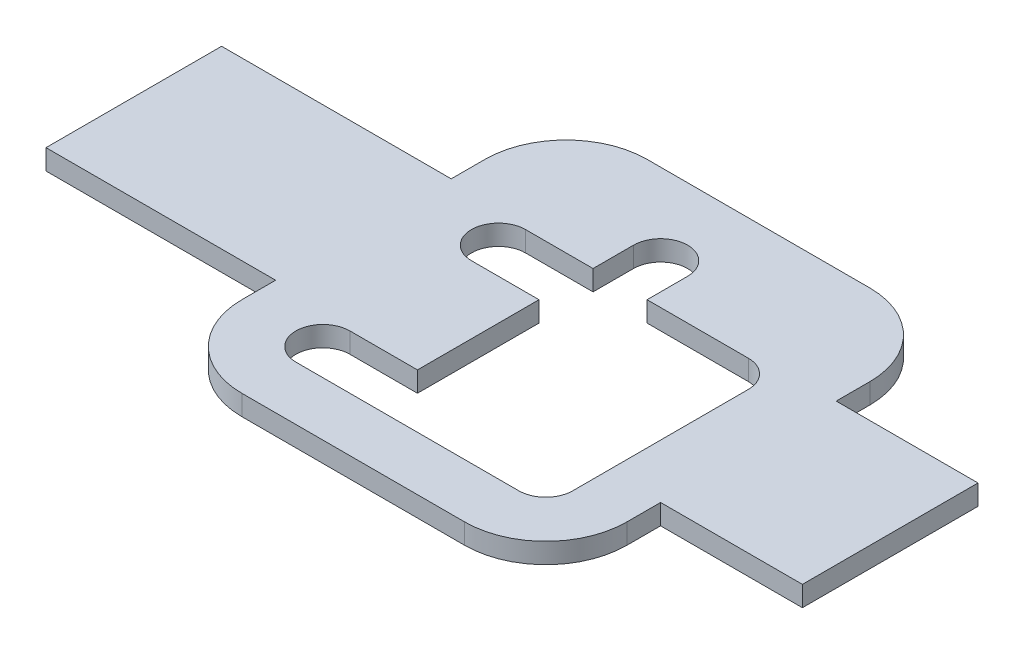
ISO-10303-21;
HEADER;
FILE_DESCRIPTION(('STEP AP214'),'2;1');
FILE_NAME('part.step','',(''),(''),'','','');
FILE_SCHEMA(('AUTOMOTIVE_DESIGN { 1 0 10303 214 1 1 1 1 }'));
ENDSEC;
DATA;
#1=APPLICATION_CONTEXT('core data for automotive mechanical design processes');
#2=APPLICATION_PROTOCOL_DEFINITION('international standard','automotive_design',2000,#1);
#3=PRODUCT_CONTEXT('',#1,'mechanical');
#4=PRODUCT('Part','Part','',(#3));
#5=PRODUCT_RELATED_PRODUCT_CATEGORY('part','',(#4));
#6=PRODUCT_DEFINITION_FORMATION('','',#4);
#7=PRODUCT_DEFINITION_CONTEXT('part definition',#1,'design');
#8=PRODUCT_DEFINITION('design','',#6,#7);
#9=PRODUCT_DEFINITION_SHAPE('','',#8);
#10=(LENGTH_UNIT() NAMED_UNIT(*) SI_UNIT(.MILLI.,.METRE.));
#11=(NAMED_UNIT(*) PLANE_ANGLE_UNIT() SI_UNIT($,.RADIAN.));
#12=(NAMED_UNIT(*) SI_UNIT($,.STERADIAN.) SOLID_ANGLE_UNIT());
#13=UNCERTAINTY_MEASURE_WITH_UNIT(LENGTH_MEASURE(1.E-05),#10,'distance_accuracy_value','');
#14=(GEOMETRIC_REPRESENTATION_CONTEXT(3) GLOBAL_UNCERTAINTY_ASSIGNED_CONTEXT((#13)) GLOBAL_UNIT_ASSIGNED_CONTEXT((#10,
#11,#12)) REPRESENTATION_CONTEXT('',''));
#15=CARTESIAN_POINT('',(0.,0.,0.));
#16=DIRECTION('',(0.,0.,1.));
#17=DIRECTION('',(1.,0.,0.));
#18=AXIS2_PLACEMENT_3D('',#15,#16,#17);
#19=CARTESIAN_POINT('',(46.,3.,5.00000000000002));
#20=DIRECTION('',(0.,-1.,0.));
#21=DIRECTION('',(0.,0.,-1.));
#22=AXIS2_PLACEMENT_3D('',#19,#20,#21);
#23=PLANE('',#22);
#24=DIRECTION('',(0.,0.,1.));
#25=VECTOR('',#24,1.);
#26=CARTESIAN_POINT('',(0.,3.,-26.));
#27=LINE('',#26,#25);
#28=CARTESIAN_POINT('',(0.,3.,-26.));
#29=VERTEX_POINT('',#28);
#30=CARTESIAN_POINT('',(0.,3.,0.));
#31=VERTEX_POINT('',#30);
#32=EDGE_CURVE('E335',#29,#31,#27,.T.);
#33=ORIENTED_EDGE('',*,*,#32,.T.);
#34=DIRECTION('',(1.,0.,0.));
#35=VECTOR('',#34,1.);
#36=CARTESIAN_POINT('',(0.,3.,0.));
#37=LINE('',#36,#35);
#38=CARTESIAN_POINT('',(34.,3.,0.));
#39=VERTEX_POINT('',#38);
#40=EDGE_CURVE('E338',#31,#39,#37,.T.);
#41=ORIENTED_EDGE('',*,*,#40,.T.);
#42=DIRECTION('',(0.,0.,1.));
#43=VECTOR('',#42,1.);
#44=CARTESIAN_POINT('',(34.,3.,0.));
#45=LINE('',#44,#43);
#46=CARTESIAN_POINT('',(34.,3.,5.00000000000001));
#47=VERTEX_POINT('',#46);
#48=EDGE_CURVE('E341',#39,#47,#45,.T.);
#49=ORIENTED_EDGE('',*,*,#48,.T.);
#50=CARTESIAN_POINT('',(46.,3.,5.00000000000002));
#51=DIRECTION('',(0.,1.,0.));
#52=DIRECTION('',(0.,0.,-1.));
#53=AXIS2_PLACEMENT_3D('',#50,#51,#52);
#54=CIRCLE('',#53,12.);
#55=CARTESIAN_POINT('',(46.,3.,17.));
#56=VERTEX_POINT('',#55);
#57=EDGE_CURVE('E343',#47,#56,#54,.T.);
#58=ORIENTED_EDGE('',*,*,#57,.T.);
#59=DIRECTION('',(1.,0.,0.));
#60=VECTOR('',#59,1.);
#61=CARTESIAN_POINT('',(46.,3.,17.));
#62=LINE('',#61,#60);
#63=CARTESIAN_POINT('',(78.9999999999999,3.,17.));
#64=VERTEX_POINT('',#63);
#65=EDGE_CURVE('E345',#56,#64,#62,.T.);
#66=ORIENTED_EDGE('',*,*,#65,.T.);
#67=CARTESIAN_POINT('',(79.,3.,5.00000000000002));
#68=DIRECTION('',(0.,1.,0.));
#69=DIRECTION('',(0.,0.,1.));
#70=AXIS2_PLACEMENT_3D('',#67,#68,#69);
#71=CIRCLE('',#70,12.);
#72=CARTESIAN_POINT('',(91.,3.,4.99999999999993));
#73=VERTEX_POINT('',#72);
#74=EDGE_CURVE('E347',#64,#73,#71,.T.);
#75=ORIENTED_EDGE('',*,*,#74,.T.);
#76=DIRECTION('',(0.,0.,-1.));
#77=VECTOR('',#76,1.);
#78=CARTESIAN_POINT('',(91.,3.,4.99999999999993));
#79=LINE('',#78,#77);
#80=CARTESIAN_POINT('',(91.,3.,0.));
#81=VERTEX_POINT('',#80);
#82=EDGE_CURVE('E349',#73,#81,#79,.T.);
#83=ORIENTED_EDGE('',*,*,#82,.T.);
#84=DIRECTION('',(1.,0.,0.));
#85=VECTOR('',#84,1.);
#86=CARTESIAN_POINT('',(91.,3.,0.));
#87=LINE('',#86,#85);
#88=CARTESIAN_POINT('',(112.,3.,0.));
#89=VERTEX_POINT('',#88);
#90=EDGE_CURVE('E351',#81,#89,#87,.T.);
#91=ORIENTED_EDGE('',*,*,#90,.T.);
#92=DIRECTION('',(0.,0.,-1.));
#93=VECTOR('',#92,1.);
#94=CARTESIAN_POINT('',(112.,3.,0.));
#95=LINE('',#94,#93);
#96=CARTESIAN_POINT('',(112.,3.,-26.));
#97=VERTEX_POINT('',#96);
#98=EDGE_CURVE('E353',#89,#97,#95,.T.);
#99=ORIENTED_EDGE('',*,*,#98,.T.);
#100=DIRECTION('',(-1.,0.,0.));
#101=VECTOR('',#100,1.);
#102=CARTESIAN_POINT('',(112.,3.,-26.));
#103=LINE('',#102,#101);
#104=CARTESIAN_POINT('',(91.,3.,-26.));
#105=VERTEX_POINT('',#104);
#106=EDGE_CURVE('E355',#97,#105,#103,.T.);
#107=ORIENTED_EDGE('',*,*,#106,.T.);
#108=DIRECTION('',(0.,0.,-1.));
#109=VECTOR('',#108,1.);
#110=CARTESIAN_POINT('',(91.,3.,-26.));
#111=LINE('',#110,#109);
#112=CARTESIAN_POINT('',(91.,3.,-31.));
#113=VERTEX_POINT('',#112);
#114=EDGE_CURVE('E357',#105,#113,#111,.T.);
#115=ORIENTED_EDGE('',*,*,#114,.T.);
#116=CARTESIAN_POINT('',(79.,3.,-31.));
#117=DIRECTION('',(0.,1.,0.));
#118=DIRECTION('',(0.,0.,1.));
#119=AXIS2_PLACEMENT_3D('',#116,#117,#118);
#120=CIRCLE('',#119,12.);
#121=CARTESIAN_POINT('',(79.,3.,-43.));
#122=VERTEX_POINT('',#121);
#123=EDGE_CURVE('E359',#113,#122,#120,.T.);
#124=ORIENTED_EDGE('',*,*,#123,.T.);
#125=DIRECTION('',(-1.,0.,0.));
#126=VECTOR('',#125,1.);
#127=CARTESIAN_POINT('',(79.,3.,-43.));
#128=LINE('',#127,#126);
#129=CARTESIAN_POINT('',(46.,3.,-43.));
#130=VERTEX_POINT('',#129);
#131=EDGE_CURVE('E361',#122,#130,#128,.T.);
#132=ORIENTED_EDGE('',*,*,#131,.T.);
#133=CARTESIAN_POINT('',(46.,3.,-31.));
#134=DIRECTION('',(0.,1.,0.));
#135=DIRECTION('',(0.,0.,-1.));
#136=AXIS2_PLACEMENT_3D('',#133,#134,#135);
#137=CIRCLE('',#136,12.);
#138=CARTESIAN_POINT('',(34.,3.,-31.));
#139=VERTEX_POINT('',#138);
#140=EDGE_CURVE('E363',#130,#139,#137,.T.);
#141=ORIENTED_EDGE('',*,*,#140,.T.);
#142=DIRECTION('',(0.,0.,1.));
#143=VECTOR('',#142,1.);
#144=CARTESIAN_POINT('',(34.,3.,-31.));
#145=LINE('',#144,#143);
#146=CARTESIAN_POINT('',(34.,3.,-26.));
#147=VERTEX_POINT('',#146);
#148=EDGE_CURVE('E365',#139,#147,#145,.T.);
#149=ORIENTED_EDGE('',*,*,#148,.T.);
#150=DIRECTION('',(-1.,0.,0.));
#151=VECTOR('',#150,1.);
#152=CARTESIAN_POINT('',(34.,3.,-26.));
#153=LINE('',#152,#151);
#154=EDGE_CURVE('E367',#147,#29,#153,.T.);
#155=ORIENTED_EDGE('',*,*,#154,.T.);
#156=EDGE_LOOP('',(#33,#41,#49,#58,#66,#75,#83,#91,#99,#107,#115,#124,#132,#141,#149,#155));
#157=FACE_BOUND('',#156,.T.);
#158=CARTESIAN_POINT('',(79.,3.,5.00000000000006));
#159=DIRECTION('',(0.,1.,0.));
#160=DIRECTION('',(0.,0.,1.));
#161=AXIS2_PLACEMENT_3D('',#158,#159,#160);
#162=CIRCLE('',#161,4.);
#163=CARTESIAN_POINT('',(79.,3.,9.00000000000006));
#164=VERTEX_POINT('',#163);
#165=CARTESIAN_POINT('',(83.,3.,5.00000000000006));
#166=VERTEX_POINT('',#165);
#167=EDGE_CURVE('E228',#164,#166,#162,.T.);
#168=ORIENTED_EDGE('',*,*,#167,.F.);
#169=DIRECTION('',(1.,0.,0.));
#170=VECTOR('',#169,1.);
#171=CARTESIAN_POINT('',(46.,3.,9.00000000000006));
#172=LINE('',#171,#170);
#173=CARTESIAN_POINT('',(46.,3.,9.00000000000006));
#174=VERTEX_POINT('',#173);
#175=EDGE_CURVE('E273',#174,#164,#172,.T.);
#176=ORIENTED_EDGE('',*,*,#175,.F.);
#177=CARTESIAN_POINT('',(46.,3.,5.00000000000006));
#178=DIRECTION('',(0.,1.,0.));
#179=DIRECTION('',(0.,0.,1.));
#180=AXIS2_PLACEMENT_3D('',#177,#178,#179);
#181=CIRCLE('',#180,4.);
#182=CARTESIAN_POINT('',(46.,3.,1.00000000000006));
#183=VERTEX_POINT('',#182);
#184=EDGE_CURVE('E271',#183,#174,#181,.T.);
#185=ORIENTED_EDGE('',*,*,#184,.F.);
#186=DIRECTION('',(-1.,0.,0.));
#187=VECTOR('',#186,1.);
#188=CARTESIAN_POINT('',(46.,3.,1.00000000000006));
#189=LINE('',#188,#187);
#190=CARTESIAN_POINT('',(56.,3.,1.00000000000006));
#191=VERTEX_POINT('',#190);
#192=EDGE_CURVE('E269',#191,#183,#189,.T.);
#193=ORIENTED_EDGE('',*,*,#192,.F.);
#194=DIRECTION('',(0.,0.,1.));
#195=VECTOR('',#194,1.);
#196=CARTESIAN_POINT('',(56.,3.,-16.9999999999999));
#197=LINE('',#196,#195);
#198=CARTESIAN_POINT('',(56.,3.,-16.9999999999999));
#199=VERTEX_POINT('',#198);
#200=EDGE_CURVE('E267',#199,#191,#197,.T.);
#201=ORIENTED_EDGE('',*,*,#200,.F.);
#202=DIRECTION('',(1.,0.,0.));
#203=VECTOR('',#202,1.);
#204=CARTESIAN_POINT('',(46.,3.,-16.9999999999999));
#205=LINE('',#204,#203);
#206=CARTESIAN_POINT('',(46.,3.,-16.9999999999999));
#207=VERTEX_POINT('',#206);
#208=EDGE_CURVE('E265',#207,#199,#205,.T.);
#209=ORIENTED_EDGE('',*,*,#208,.F.);
#210=CARTESIAN_POINT('',(46.,3.,-20.9999999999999));
#211=DIRECTION('',(0.,1.,0.));
#212=DIRECTION('',(0.,0.,1.));
#213=AXIS2_PLACEMENT_3D('',#210,#211,#212);
#214=CIRCLE('',#213,4.);
#215=CARTESIAN_POINT('',(46.,3.,-24.9999999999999));
#216=VERTEX_POINT('',#215);
#217=EDGE_CURVE('E263',#216,#207,#214,.T.);
#218=ORIENTED_EDGE('',*,*,#217,.F.);
#219=DIRECTION('',(-1.,0.,0.));
#220=VECTOR('',#219,1.);
#221=CARTESIAN_POINT('',(56.,3.,-24.9999999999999));
#222=LINE('',#221,#220);
#223=CARTESIAN_POINT('',(56.,3.,-24.9999999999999));
#224=VERTEX_POINT('',#223);
#225=EDGE_CURVE('E261',#224,#216,#222,.T.);
#226=ORIENTED_EDGE('',*,*,#225,.F.);
#227=DIRECTION('',(0.,0.,1.));
#228=VECTOR('',#227,1.);
#229=CARTESIAN_POINT('',(56.,3.,-30.9999999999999));
#230=LINE('',#229,#228);
#231=CARTESIAN_POINT('',(56.,3.,-30.9999999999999));
#232=VERTEX_POINT('',#231);
#233=EDGE_CURVE('E259',#232,#224,#230,.T.);
#234=ORIENTED_EDGE('',*,*,#233,.F.);
#235=CARTESIAN_POINT('',(60.,3.,-30.9999999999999));
#236=DIRECTION('',(0.,1.,0.));
#237=DIRECTION('',(0.,0.,1.));
#238=AXIS2_PLACEMENT_3D('',#235,#236,#237);
#239=CIRCLE('',#238,4.);
#240=CARTESIAN_POINT('',(64.,3.,-30.9999999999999));
#241=VERTEX_POINT('',#240);
#242=EDGE_CURVE('E257',#241,#232,#239,.T.);
#243=ORIENTED_EDGE('',*,*,#242,.F.);
#244=DIRECTION('',(0.,0.,-1.));
#245=VECTOR('',#244,1.);
#246=CARTESIAN_POINT('',(64.,3.,-30.9999999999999));
#247=LINE('',#246,#245);
#248=CARTESIAN_POINT('',(64.,3.,-24.9999999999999));
#249=VERTEX_POINT('',#248);
#250=EDGE_CURVE('E255',#249,#241,#247,.T.);
#251=ORIENTED_EDGE('',*,*,#250,.F.);
#252=DIRECTION('',(-1.,0.,0.));
#253=VECTOR('',#252,1.);
#254=CARTESIAN_POINT('',(79.,3.,-25.));
#255=LINE('',#254,#253);
#256=CARTESIAN_POINT('',(79.,3.,-25.));
#257=VERTEX_POINT('',#256);
#258=EDGE_CURVE('E251',#257,#249,#255,.T.);
#259=ORIENTED_EDGE('',*,*,#258,.F.);
#260=CARTESIAN_POINT('',(79.,3.,-20.9999999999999));
#261=DIRECTION('',(0.,1.,0.));
#262=DIRECTION('',(0.,0.,1.));
#263=AXIS2_PLACEMENT_3D('',#260,#261,#262);
#264=CIRCLE('',#263,4.00000000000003);
#265=CARTESIAN_POINT('',(83.,3.,-20.9999999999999));
#266=VERTEX_POINT('',#265);
#267=EDGE_CURVE('E249',#266,#257,#264,.T.);
#268=ORIENTED_EDGE('',*,*,#267,.F.);
#269=DIRECTION('',(0.,0.,-1.));
#270=VECTOR('',#269,1.);
#271=CARTESIAN_POINT('',(83.,3.,5.00000000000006));
#272=LINE('',#271,#270);
#273=EDGE_CURVE('E236',#166,#266,#272,.T.);
#274=ORIENTED_EDGE('',*,*,#273,.F.);
#275=EDGE_LOOP('',(#168,#176,#185,#193,#201,#209,#218,#226,#234,#243,#251,#259,#268,#274));
#276=FACE_BOUND('',#275,.T.);
#277=ADVANCED_FACE('F31',(#157,#276),#23,.F.);
#278=CARTESIAN_POINT('',(46.,0.,5.00000000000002));
#279=DIRECTION('',(0.,-1.,0.));
#280=DIRECTION('',(0.,0.,-1.));
#281=AXIS2_PLACEMENT_3D('',#278,#279,#280);
#282=PLANE('',#281);
#283=DIRECTION('',(0.,0.,1.));
#284=VECTOR('',#283,1.);
#285=CARTESIAN_POINT('',(0.,0.,-26.));
#286=LINE('',#285,#284);
#287=CARTESIAN_POINT('',(0.,0.,-26.));
#288=VERTEX_POINT('',#287);
#289=CARTESIAN_POINT('',(0.,0.,0.));
#290=VERTEX_POINT('',#289);
#291=EDGE_CURVE('E244',#288,#290,#286,.T.);
#292=ORIENTED_EDGE('',*,*,#291,.F.);
#293=DIRECTION('',(-1.,0.,0.));
#294=VECTOR('',#293,1.);
#295=CARTESIAN_POINT('',(34.,0.,-26.));
#296=LINE('',#295,#294);
#297=CARTESIAN_POINT('',(34.,0.,-26.));
#298=VERTEX_POINT('',#297);
#299=EDGE_CURVE('E339',#298,#288,#296,.T.);
#300=ORIENTED_EDGE('',*,*,#299,.F.);
#301=DIRECTION('',(0.,0.,1.));
#302=VECTOR('',#301,1.);
#303=CARTESIAN_POINT('',(34.,0.,-31.));
#304=LINE('',#303,#302);
#305=CARTESIAN_POINT('',(34.,0.,-31.));
#306=VERTEX_POINT('',#305);
#307=EDGE_CURVE('E398',#306,#298,#304,.T.);
#308=ORIENTED_EDGE('',*,*,#307,.F.);
#309=CARTESIAN_POINT('',(46.,0.,-31.));
#310=DIRECTION('',(0.,1.,0.));
#311=DIRECTION('',(0.,0.,-1.));
#312=AXIS2_PLACEMENT_3D('',#309,#310,#311);
#313=CIRCLE('',#312,12.);
#314=CARTESIAN_POINT('',(46.,0.,-43.));
#315=VERTEX_POINT('',#314);
#316=EDGE_CURVE('E396',#315,#306,#313,.T.);
#317=ORIENTED_EDGE('',*,*,#316,.F.);
#318=DIRECTION('',(-1.,0.,0.));
#319=VECTOR('',#318,1.);
#320=CARTESIAN_POINT('',(79.,0.,-43.));
#321=LINE('',#320,#319);
#322=CARTESIAN_POINT('',(79.,0.,-43.));
#323=VERTEX_POINT('',#322);
#324=EDGE_CURVE('E394',#323,#315,#321,.T.);
#325=ORIENTED_EDGE('',*,*,#324,.F.);
#326=CARTESIAN_POINT('',(79.,0.,-31.));
#327=DIRECTION('',(0.,1.,0.));
#328=DIRECTION('',(0.,0.,1.));
#329=AXIS2_PLACEMENT_3D('',#326,#327,#328);
#330=CIRCLE('',#329,12.);
#331=CARTESIAN_POINT('',(91.,0.,-31.));
#332=VERTEX_POINT('',#331);
#333=EDGE_CURVE('E392',#332,#323,#330,.T.);
#334=ORIENTED_EDGE('',*,*,#333,.F.);
#335=DIRECTION('',(0.,0.,-1.));
#336=VECTOR('',#335,1.);
#337=CARTESIAN_POINT('',(91.,0.,-26.));
#338=LINE('',#337,#336);
#339=CARTESIAN_POINT('',(91.,0.,-26.));
#340=VERTEX_POINT('',#339);
#341=EDGE_CURVE('E390',#340,#332,#338,.T.);
#342=ORIENTED_EDGE('',*,*,#341,.F.);
#343=DIRECTION('',(-1.,0.,0.));
#344=VECTOR('',#343,1.);
#345=CARTESIAN_POINT('',(112.,0.,-26.));
#346=LINE('',#345,#344);
#347=CARTESIAN_POINT('',(112.,0.,-26.));
#348=VERTEX_POINT('',#347);
#349=EDGE_CURVE('E388',#348,#340,#346,.T.);
#350=ORIENTED_EDGE('',*,*,#349,.F.);
#351=DIRECTION('',(0.,0.,-1.));
#352=VECTOR('',#351,1.);
#353=CARTESIAN_POINT('',(112.,0.,0.));
#354=LINE('',#353,#352);
#355=CARTESIAN_POINT('',(112.,0.,0.));
#356=VERTEX_POINT('',#355);
#357=EDGE_CURVE('E386',#356,#348,#354,.T.);
#358=ORIENTED_EDGE('',*,*,#357,.F.);
#359=DIRECTION('',(1.,0.,0.));
#360=VECTOR('',#359,1.);
#361=CARTESIAN_POINT('',(91.,0.,0.));
#362=LINE('',#361,#360);
#363=CARTESIAN_POINT('',(91.,0.,0.));
#364=VERTEX_POINT('',#363);
#365=EDGE_CURVE('E384',#364,#356,#362,.T.);
#366=ORIENTED_EDGE('',*,*,#365,.F.);
#367=DIRECTION('',(0.,0.,-1.));
#368=VECTOR('',#367,1.);
#369=CARTESIAN_POINT('',(91.,0.,4.99999999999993));
#370=LINE('',#369,#368);
#371=CARTESIAN_POINT('',(91.,0.,4.99999999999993));
#372=VERTEX_POINT('',#371);
#373=EDGE_CURVE('E382',#372,#364,#370,.T.);
#374=ORIENTED_EDGE('',*,*,#373,.F.);
#375=CARTESIAN_POINT('',(79.,0.,5.00000000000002));
#376=DIRECTION('',(0.,1.,0.));
#377=DIRECTION('',(0.,0.,1.));
#378=AXIS2_PLACEMENT_3D('',#375,#376,#377);
#379=CIRCLE('',#378,12.);
#380=CARTESIAN_POINT('',(78.9999999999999,0.,17.));
#381=VERTEX_POINT('',#380);
#382=EDGE_CURVE('E380',#381,#372,#379,.T.);
#383=ORIENTED_EDGE('',*,*,#382,.F.);
#384=DIRECTION('',(1.,0.,0.));
#385=VECTOR('',#384,1.);
#386=CARTESIAN_POINT('',(46.,0.,17.));
#387=LINE('',#386,#385);
#388=CARTESIAN_POINT('',(46.,0.,17.));
#389=VERTEX_POINT('',#388);
#390=EDGE_CURVE('E378',#389,#381,#387,.T.);
#391=ORIENTED_EDGE('',*,*,#390,.F.);
#392=CARTESIAN_POINT('',(46.,0.,5.00000000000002));
#393=DIRECTION('',(0.,1.,0.));
#394=DIRECTION('',(0.,0.,-1.));
#395=AXIS2_PLACEMENT_3D('',#392,#393,#394);
#396=CIRCLE('',#395,12.);
#397=CARTESIAN_POINT('',(34.,0.,5.00000000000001));
#398=VERTEX_POINT('',#397);
#399=EDGE_CURVE('E376',#398,#389,#396,.T.);
#400=ORIENTED_EDGE('',*,*,#399,.F.);
#401=DIRECTION('',(0.,0.,1.));
#402=VECTOR('',#401,1.);
#403=CARTESIAN_POINT('',(34.,0.,0.));
#404=LINE('',#403,#402);
#405=CARTESIAN_POINT('',(34.,0.,0.));
#406=VERTEX_POINT('',#405);
#407=EDGE_CURVE('E374',#406,#398,#404,.T.);
#408=ORIENTED_EDGE('',*,*,#407,.F.);
#409=DIRECTION('',(1.,0.,0.));
#410=VECTOR('',#409,1.);
#411=CARTESIAN_POINT('',(0.,0.,0.));
#412=LINE('',#411,#410);
#413=EDGE_CURVE('E372',#290,#406,#412,.T.);
#414=ORIENTED_EDGE('',*,*,#413,.F.);
#415=EDGE_LOOP('',(#292,#300,#308,#317,#325,#334,#342,#350,#358,#366,#374,#383,#391,#400,#408,#414));
#416=FACE_BOUND('',#415,.T.);
#417=DIRECTION('',(1.,0.,0.));
#418=VECTOR('',#417,1.);
#419=CARTESIAN_POINT('',(46.,0.,9.00000000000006));
#420=LINE('',#419,#418);
#421=CARTESIAN_POINT('',(46.,0.,9.00000000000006));
#422=VERTEX_POINT('',#421);
#423=CARTESIAN_POINT('',(79.,0.,9.00000000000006));
#424=VERTEX_POINT('',#423);
#425=EDGE_CURVE('E237',#422,#424,#420,.T.);
#426=ORIENTED_EDGE('',*,*,#425,.T.);
#427=CARTESIAN_POINT('',(79.,0.,5.00000000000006));
#428=DIRECTION('',(0.,1.,0.));
#429=DIRECTION('',(0.,0.,1.));
#430=AXIS2_PLACEMENT_3D('',#427,#428,#429);
#431=CIRCLE('',#430,4.);
#432=CARTESIAN_POINT('',(83.,0.,5.00000000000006));
#433=VERTEX_POINT('',#432);
#434=EDGE_CURVE('E54',#424,#433,#431,.T.);
#435=ORIENTED_EDGE('',*,*,#434,.T.);
#436=DIRECTION('',(0.,0.,-1.));
#437=VECTOR('',#436,1.);
#438=CARTESIAN_POINT('',(83.,0.,5.00000000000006));
#439=LINE('',#438,#437);
#440=CARTESIAN_POINT('',(83.,0.,-20.9999999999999));
#441=VERTEX_POINT('',#440);
#442=EDGE_CURVE('E243',#433,#441,#439,.T.);
#443=ORIENTED_EDGE('',*,*,#442,.T.);
#444=CARTESIAN_POINT('',(79.,0.,-20.9999999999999));
#445=DIRECTION('',(0.,1.,0.));
#446=DIRECTION('',(0.,0.,1.));
#447=AXIS2_PLACEMENT_3D('',#444,#445,#446);
#448=CIRCLE('',#447,4.00000000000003);
#449=CARTESIAN_POINT('',(79.,0.,-25.));
#450=VERTEX_POINT('',#449);
#451=EDGE_CURVE('E277',#441,#450,#448,.T.);
#452=ORIENTED_EDGE('',*,*,#451,.T.);
#453=DIRECTION('',(-1.,0.,0.));
#454=VECTOR('',#453,1.);
#455=CARTESIAN_POINT('',(79.,0.,-25.));
#456=LINE('',#455,#454);
#457=CARTESIAN_POINT('',(64.,0.,-24.9999999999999));
#458=VERTEX_POINT('',#457);
#459=EDGE_CURVE('E280',#450,#458,#456,.T.);
#460=ORIENTED_EDGE('',*,*,#459,.T.);
#461=DIRECTION('',(0.,0.,-1.));
#462=VECTOR('',#461,1.);
#463=CARTESIAN_POINT('',(64.,0.,-30.9999999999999));
#464=LINE('',#463,#462);
#465=CARTESIAN_POINT('',(64.,0.,-30.9999999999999));
#466=VERTEX_POINT('',#465);
#467=EDGE_CURVE('E283',#458,#466,#464,.T.);
#468=ORIENTED_EDGE('',*,*,#467,.T.);
#469=CARTESIAN_POINT('',(60.,0.,-30.9999999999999));
#470=DIRECTION('',(0.,1.,0.));
#471=DIRECTION('',(0.,0.,1.));
#472=AXIS2_PLACEMENT_3D('',#469,#470,#471);
#473=CIRCLE('',#472,4.);
#474=CARTESIAN_POINT('',(56.,0.,-30.9999999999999));
#475=VERTEX_POINT('',#474);
#476=EDGE_CURVE('E286',#466,#475,#473,.T.);
#477=ORIENTED_EDGE('',*,*,#476,.T.);
#478=DIRECTION('',(0.,0.,1.));
#479=VECTOR('',#478,1.);
#480=CARTESIAN_POINT('',(56.,0.,-30.9999999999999));
#481=LINE('',#480,#479);
#482=CARTESIAN_POINT('',(56.,0.,-24.9999999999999));
#483=VERTEX_POINT('',#482);
#484=EDGE_CURVE('E289',#475,#483,#481,.T.);
#485=ORIENTED_EDGE('',*,*,#484,.T.);
#486=DIRECTION('',(-1.,0.,0.));
#487=VECTOR('',#486,1.);
#488=CARTESIAN_POINT('',(56.,0.,-24.9999999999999));
#489=LINE('',#488,#487);
#490=CARTESIAN_POINT('',(46.,0.,-24.9999999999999));
#491=VERTEX_POINT('',#490);
#492=EDGE_CURVE('E292',#483,#491,#489,.T.);
#493=ORIENTED_EDGE('',*,*,#492,.T.);
#494=CARTESIAN_POINT('',(46.,0.,-20.9999999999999));
#495=DIRECTION('',(0.,1.,0.));
#496=DIRECTION('',(0.,0.,1.));
#497=AXIS2_PLACEMENT_3D('',#494,#495,#496);
#498=CIRCLE('',#497,4.);
#499=CARTESIAN_POINT('',(46.,0.,-16.9999999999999));
#500=VERTEX_POINT('',#499);
#501=EDGE_CURVE('E295',#491,#500,#498,.T.);
#502=ORIENTED_EDGE('',*,*,#501,.T.);
#503=DIRECTION('',(1.,0.,0.));
#504=VECTOR('',#503,1.);
#505=CARTESIAN_POINT('',(46.,0.,-16.9999999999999));
#506=LINE('',#505,#504);
#507=CARTESIAN_POINT('',(56.,0.,-16.9999999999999));
#508=VERTEX_POINT('',#507);
#509=EDGE_CURVE('E298',#500,#508,#506,.T.);
#510=ORIENTED_EDGE('',*,*,#509,.T.);
#511=DIRECTION('',(0.,0.,1.));
#512=VECTOR('',#511,1.);
#513=CARTESIAN_POINT('',(56.,0.,-16.9999999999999));
#514=LINE('',#513,#512);
#515=CARTESIAN_POINT('',(56.,0.,1.00000000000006));
#516=VERTEX_POINT('',#515);
#517=EDGE_CURVE('E301',#508,#516,#514,.T.);
#518=ORIENTED_EDGE('',*,*,#517,.T.);
#519=DIRECTION('',(-1.,0.,0.));
#520=VECTOR('',#519,1.);
#521=CARTESIAN_POINT('',(46.,0.,1.00000000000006));
#522=LINE('',#521,#520);
#523=CARTESIAN_POINT('',(46.,0.,1.00000000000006));
#524=VERTEX_POINT('',#523);
#525=EDGE_CURVE('E304',#516,#524,#522,.T.);
#526=ORIENTED_EDGE('',*,*,#525,.T.);
#527=CARTESIAN_POINT('',(46.,0.,5.00000000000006));
#528=DIRECTION('',(0.,1.,0.));
#529=DIRECTION('',(0.,0.,1.));
#530=AXIS2_PLACEMENT_3D('',#527,#528,#529);
#531=CIRCLE('',#530,4.);
#532=EDGE_CURVE('E307',#524,#422,#531,.T.);
#533=ORIENTED_EDGE('',*,*,#532,.T.);
#534=EDGE_LOOP('',(#426,#435,#443,#452,#460,#468,#477,#485,#493,#502,#510,#518,#526,#533));
#535=FACE_BOUND('',#534,.T.);
#536=ADVANCED_FACE('F452',(#416,#535),#282,.T.);
#537=CARTESIAN_POINT('',(0.,3.,-26.));
#538=DIRECTION('',(1.,0.,0.));
#539=DIRECTION('',(0.,0.,-1.));
#540=AXIS2_PLACEMENT_3D('',#537,#538,#539);
#541=PLANE('',#540);
#542=ORIENTED_EDGE('',*,*,#291,.T.);
#543=DIRECTION('',(0.,-1.,0.));
#544=VECTOR('',#543,1.);
#545=CARTESIAN_POINT('',(0.,3.,0.));
#546=LINE('',#545,#544);
#547=EDGE_CURVE('E11',#31,#290,#546,.T.);
#548=ORIENTED_EDGE('',*,*,#547,.F.);
#549=ORIENTED_EDGE('',*,*,#32,.F.);
#550=DIRECTION('',(0.,-1.,0.));
#551=VECTOR('',#550,1.);
#552=CARTESIAN_POINT('',(0.,3.,-26.));
#553=LINE('',#552,#551);
#554=EDGE_CURVE('E369',#29,#288,#553,.T.);
#555=ORIENTED_EDGE('',*,*,#554,.T.);
#556=EDGE_LOOP('',(#542,#548,#549,#555));
#557=FACE_BOUND('',#556,.T.);
#558=ADVANCED_FACE('F33',(#557),#541,.F.);
#559=CARTESIAN_POINT('',(0.,3.,0.));
#560=DIRECTION('',(0.,0.,-1.));
#561=DIRECTION('',(-1.,0.,0.));
#562=AXIS2_PLACEMENT_3D('',#559,#560,#561);
#563=PLANE('',#562);
#564=ORIENTED_EDGE('',*,*,#413,.T.);
#565=DIRECTION('',(0.,-1.,0.));
#566=VECTOR('',#565,1.);
#567=CARTESIAN_POINT('',(34.,3.,0.));
#568=LINE('',#567,#566);
#569=EDGE_CURVE('E39',#39,#406,#568,.T.);
#570=ORIENTED_EDGE('',*,*,#569,.F.);
#571=ORIENTED_EDGE('',*,*,#40,.F.);
#572=ORIENTED_EDGE('',*,*,#547,.T.);
#573=EDGE_LOOP('',(#564,#570,#571,#572));
#574=FACE_BOUND('',#573,.T.);
#575=ADVANCED_FACE('F469',(#574),#563,.F.);
#576=CARTESIAN_POINT('',(34.,3.,0.));
#577=DIRECTION('',(1.,0.,0.));
#578=DIRECTION('',(0.,0.,-1.));
#579=AXIS2_PLACEMENT_3D('',#576,#577,#578);
#580=PLANE('',#579);
#581=ORIENTED_EDGE('',*,*,#407,.T.);
#582=DIRECTION('',(0.,-1.,0.));
#583=VECTOR('',#582,1.);
#584=CARTESIAN_POINT('',(34.,3.,5.00000000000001));
#585=LINE('',#584,#583);
#586=EDGE_CURVE('E439',#47,#398,#585,.T.);
#587=ORIENTED_EDGE('',*,*,#586,.F.);
#588=ORIENTED_EDGE('',*,*,#48,.F.);
#589=ORIENTED_EDGE('',*,*,#569,.T.);
#590=EDGE_LOOP('',(#581,#587,#588,#589));
#591=FACE_BOUND('',#590,.T.);
#592=ADVANCED_FACE('F446',(#591),#580,.F.);
#593=CARTESIAN_POINT('',(46.,3.,5.00000000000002));
#594=DIRECTION('',(0.,-1.,0.));
#595=DIRECTION('',(0.,0.,-1.));
#596=AXIS2_PLACEMENT_3D('',#593,#594,#595);
#597=CYLINDRICAL_SURFACE('',#596,12.);
#598=ORIENTED_EDGE('',*,*,#399,.T.);
#599=DIRECTION('',(0.,-1.,0.));
#600=VECTOR('',#599,1.);
#601=CARTESIAN_POINT('',(46.,3.,17.));
#602=LINE('',#601,#600);
#603=EDGE_CURVE('E436',#56,#389,#602,.T.);
#604=ORIENTED_EDGE('',*,*,#603,.F.);
#605=ORIENTED_EDGE('',*,*,#57,.F.);
#606=ORIENTED_EDGE('',*,*,#586,.T.);
#607=EDGE_LOOP('',(#598,#604,#605,#606));
#608=FACE_BOUND('',#607,.T.);
#609=ADVANCED_FACE('F458',(#608),#597,.T.);
#610=CARTESIAN_POINT('',(46.,3.,17.));
#611=DIRECTION('',(0.,0.,-1.));
#612=DIRECTION('',(-1.,0.,0.));
#613=AXIS2_PLACEMENT_3D('',#610,#611,#612);
#614=PLANE('',#613);
#615=ORIENTED_EDGE('',*,*,#390,.T.);
#616=DIRECTION('',(0.,-1.,0.));
#617=VECTOR('',#616,1.);
#618=CARTESIAN_POINT('',(78.9999999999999,3.,17.));
#619=LINE('',#618,#617);
#620=EDGE_CURVE('E433',#64,#381,#619,.T.);
#621=ORIENTED_EDGE('',*,*,#620,.F.);
#622=ORIENTED_EDGE('',*,*,#65,.F.);
#623=ORIENTED_EDGE('',*,*,#603,.T.);
#624=EDGE_LOOP('',(#615,#621,#622,#623));
#625=FACE_BOUND('',#624,.T.);
#626=ADVANCED_FACE('F462',(#625),#614,.F.);
#627=CARTESIAN_POINT('',(79.,3.,5.00000000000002));
#628=DIRECTION('',(0.,-1.,0.));
#629=DIRECTION('',(0.,0.,-1.));
#630=AXIS2_PLACEMENT_3D('',#627,#628,#629);
#631=CYLINDRICAL_SURFACE('',#630,12.);
#632=ORIENTED_EDGE('',*,*,#382,.T.);
#633=DIRECTION('',(0.,-1.,0.));
#634=VECTOR('',#633,1.);
#635=CARTESIAN_POINT('',(91.,3.,4.99999999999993));
#636=LINE('',#635,#634);
#637=EDGE_CURVE('E430',#73,#372,#636,.T.);
#638=ORIENTED_EDGE('',*,*,#637,.F.);
#639=ORIENTED_EDGE('',*,*,#74,.F.);
#640=ORIENTED_EDGE('',*,*,#620,.T.);
#641=EDGE_LOOP('',(#632,#638,#639,#640));
#642=FACE_BOUND('',#641,.T.);
#643=ADVANCED_FACE('F522',(#642),#631,.T.);
#644=CARTESIAN_POINT('',(91.,3.,4.99999999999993));
#645=DIRECTION('',(-1.,0.,0.));
#646=DIRECTION('',(0.,0.,1.));
#647=AXIS2_PLACEMENT_3D('',#644,#645,#646);
#648=PLANE('',#647);
#649=ORIENTED_EDGE('',*,*,#373,.T.);
#650=DIRECTION('',(0.,-1.,0.));
#651=VECTOR('',#650,1.);
#652=CARTESIAN_POINT('',(91.,3.,0.));
#653=LINE('',#652,#651);
#654=EDGE_CURVE('E427',#81,#364,#653,.T.);
#655=ORIENTED_EDGE('',*,*,#654,.F.);
#656=ORIENTED_EDGE('',*,*,#82,.F.);
#657=ORIENTED_EDGE('',*,*,#637,.T.);
#658=EDGE_LOOP('',(#649,#655,#656,#657));
#659=FACE_BOUND('',#658,.T.);
#660=ADVANCED_FACE('F519',(#659),#648,.F.);
#661=CARTESIAN_POINT('',(91.,3.,0.));
#662=DIRECTION('',(0.,0.,-1.));
#663=DIRECTION('',(-1.,0.,0.));
#664=AXIS2_PLACEMENT_3D('',#661,#662,#663);
#665=PLANE('',#664);
#666=ORIENTED_EDGE('',*,*,#365,.T.);
#667=DIRECTION('',(0.,-1.,0.));
#668=VECTOR('',#667,1.);
#669=CARTESIAN_POINT('',(112.,3.,0.));
#670=LINE('',#669,#668);
#671=EDGE_CURVE('E424',#89,#356,#670,.T.);
#672=ORIENTED_EDGE('',*,*,#671,.F.);
#673=ORIENTED_EDGE('',*,*,#90,.F.);
#674=ORIENTED_EDGE('',*,*,#654,.T.);
#675=EDGE_LOOP('',(#666,#672,#673,#674));
#676=FACE_BOUND('',#675,.T.);
#677=ADVANCED_FACE('F515',(#676),#665,.F.);
#678=CARTESIAN_POINT('',(112.,3.,0.));
#679=DIRECTION('',(-1.,0.,0.));
#680=DIRECTION('',(0.,0.,1.));
#681=AXIS2_PLACEMENT_3D('',#678,#679,#680);
#682=PLANE('',#681);
#683=ORIENTED_EDGE('',*,*,#357,.T.);
#684=DIRECTION('',(0.,-1.,0.));
#685=VECTOR('',#684,1.);
#686=CARTESIAN_POINT('',(112.,3.,-26.));
#687=LINE('',#686,#685);
#688=EDGE_CURVE('E421',#97,#348,#687,.T.);
#689=ORIENTED_EDGE('',*,*,#688,.F.);
#690=ORIENTED_EDGE('',*,*,#98,.F.);
#691=ORIENTED_EDGE('',*,*,#671,.T.);
#692=EDGE_LOOP('',(#683,#689,#690,#691));
#693=FACE_BOUND('',#692,.T.);
#694=ADVANCED_FACE('F511',(#693),#682,.F.);
#695=CARTESIAN_POINT('',(112.,3.,-26.));
#696=DIRECTION('',(0.,0.,1.));
#697=DIRECTION('',(1.,0.,0.));
#698=AXIS2_PLACEMENT_3D('',#695,#696,#697);
#699=PLANE('',#698);
#700=ORIENTED_EDGE('',*,*,#349,.T.);
#701=DIRECTION('',(0.,-1.,0.));
#702=VECTOR('',#701,1.);
#703=CARTESIAN_POINT('',(91.,3.,-26.));
#704=LINE('',#703,#702);
#705=EDGE_CURVE('E418',#105,#340,#704,.T.);
#706=ORIENTED_EDGE('',*,*,#705,.F.);
#707=ORIENTED_EDGE('',*,*,#106,.F.);
#708=ORIENTED_EDGE('',*,*,#688,.T.);
#709=EDGE_LOOP('',(#700,#706,#707,#708));
#710=FACE_BOUND('',#709,.T.);
#711=ADVANCED_FACE('F506',(#710),#699,.F.);
#712=CARTESIAN_POINT('',(91.,3.,-26.));
#713=DIRECTION('',(-1.,0.,0.));
#714=DIRECTION('',(0.,0.,1.));
#715=AXIS2_PLACEMENT_3D('',#712,#713,#714);
#716=PLANE('',#715);
#717=ORIENTED_EDGE('',*,*,#341,.T.);
#718=DIRECTION('',(0.,-1.,0.));
#719=VECTOR('',#718,1.);
#720=CARTESIAN_POINT('',(91.,3.,-31.));
#721=LINE('',#720,#719);
#722=EDGE_CURVE('E415',#113,#332,#721,.T.);
#723=ORIENTED_EDGE('',*,*,#722,.F.);
#724=ORIENTED_EDGE('',*,*,#114,.F.);
#725=ORIENTED_EDGE('',*,*,#705,.T.);
#726=EDGE_LOOP('',(#717,#723,#724,#725));
#727=FACE_BOUND('',#726,.T.);
#728=ADVANCED_FACE('F500',(#727),#716,.F.);
#729=CARTESIAN_POINT('',(79.,3.,-31.));
#730=DIRECTION('',(0.,-1.,0.));
#731=DIRECTION('',(0.,0.,-1.));
#732=AXIS2_PLACEMENT_3D('',#729,#730,#731);
#733=CYLINDRICAL_SURFACE('',#732,12.);
#734=ORIENTED_EDGE('',*,*,#333,.T.);
#735=DIRECTION('',(0.,-1.,0.));
#736=VECTOR('',#735,1.);
#737=CARTESIAN_POINT('',(79.,3.,-43.));
#738=LINE('',#737,#736);
#739=EDGE_CURVE('E412',#122,#323,#738,.T.);
#740=ORIENTED_EDGE('',*,*,#739,.F.);
#741=ORIENTED_EDGE('',*,*,#123,.F.);
#742=ORIENTED_EDGE('',*,*,#722,.T.);
#743=EDGE_LOOP('',(#734,#740,#741,#742));
#744=FACE_BOUND('',#743,.T.);
#745=ADVANCED_FACE('F496',(#744),#733,.T.);
#746=CARTESIAN_POINT('',(79.,3.,-43.));
#747=DIRECTION('',(0.,0.,1.));
#748=DIRECTION('',(1.,0.,0.));
#749=AXIS2_PLACEMENT_3D('',#746,#747,#748);
#750=PLANE('',#749);
#751=ORIENTED_EDGE('',*,*,#324,.T.);
#752=DIRECTION('',(0.,-1.,0.));
#753=VECTOR('',#752,1.);
#754=CARTESIAN_POINT('',(46.,3.,-43.));
#755=LINE('',#754,#753);
#756=EDGE_CURVE('E409',#130,#315,#755,.T.);
#757=ORIENTED_EDGE('',*,*,#756,.F.);
#758=ORIENTED_EDGE('',*,*,#131,.F.);
#759=ORIENTED_EDGE('',*,*,#739,.T.);
#760=EDGE_LOOP('',(#751,#757,#758,#759));
#761=FACE_BOUND('',#760,.T.);
#762=ADVANCED_FACE('F491',(#761),#750,.F.);
#763=CARTESIAN_POINT('',(46.,3.,-31.));
#764=DIRECTION('',(0.,-1.,0.));
#765=DIRECTION('',(0.,0.,-1.));
#766=AXIS2_PLACEMENT_3D('',#763,#764,#765);
#767=CYLINDRICAL_SURFACE('',#766,12.);
#768=ORIENTED_EDGE('',*,*,#316,.T.);
#769=DIRECTION('',(0.,-1.,0.));
#770=VECTOR('',#769,1.);
#771=CARTESIAN_POINT('',(34.,3.,-31.));
#772=LINE('',#771,#770);
#773=EDGE_CURVE('E406',#139,#306,#772,.T.);
#774=ORIENTED_EDGE('',*,*,#773,.F.);
#775=ORIENTED_EDGE('',*,*,#140,.F.);
#776=ORIENTED_EDGE('',*,*,#756,.T.);
#777=EDGE_LOOP('',(#768,#774,#775,#776));
#778=FACE_BOUND('',#777,.T.);
#779=ADVANCED_FACE('F485',(#778),#767,.T.);
#780=CARTESIAN_POINT('',(34.,3.,-31.));
#781=DIRECTION('',(1.,0.,0.));
#782=DIRECTION('',(0.,0.,-1.));
#783=AXIS2_PLACEMENT_3D('',#780,#781,#782);
#784=PLANE('',#783);
#785=ORIENTED_EDGE('',*,*,#307,.T.);
#786=DIRECTION('',(0.,-1.,0.));
#787=VECTOR('',#786,1.);
#788=CARTESIAN_POINT('',(34.,3.,-26.));
#789=LINE('',#788,#787);
#790=EDGE_CURVE('E403',#147,#298,#789,.T.);
#791=ORIENTED_EDGE('',*,*,#790,.F.);
#792=ORIENTED_EDGE('',*,*,#148,.F.);
#793=ORIENTED_EDGE('',*,*,#773,.T.);
#794=EDGE_LOOP('',(#785,#791,#792,#793));
#795=FACE_BOUND('',#794,.T.);
#796=ADVANCED_FACE('F481',(#795),#784,.F.);
#797=CARTESIAN_POINT('',(34.,3.,-26.));
#798=DIRECTION('',(0.,0.,1.));
#799=DIRECTION('',(1.,0.,0.));
#800=AXIS2_PLACEMENT_3D('',#797,#798,#799);
#801=PLANE('',#800);
#802=ORIENTED_EDGE('',*,*,#299,.T.);
#803=ORIENTED_EDGE('',*,*,#554,.F.);
#804=ORIENTED_EDGE('',*,*,#154,.F.);
#805=ORIENTED_EDGE('',*,*,#790,.T.);
#806=EDGE_LOOP('',(#802,#803,#804,#805));
#807=FACE_BOUND('',#806,.T.);
#808=ADVANCED_FACE('F476',(#807),#801,.F.);
#809=CARTESIAN_POINT('',(79.,3.,5.00000000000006));
#810=DIRECTION('',(0.,-1.,0.));
#811=DIRECTION('',(0.,0.,-1.));
#812=AXIS2_PLACEMENT_3D('',#809,#810,#811);
#813=CYLINDRICAL_SURFACE('',#812,4.);
#814=ORIENTED_EDGE('',*,*,#434,.F.);
#815=DIRECTION('',(0.,-1.,0.));
#816=VECTOR('',#815,1.);
#817=CARTESIAN_POINT('',(79.,3.,9.00000000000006));
#818=LINE('',#817,#816);
#819=EDGE_CURVE('E232',#164,#424,#818,.T.);
#820=ORIENTED_EDGE('',*,*,#819,.F.);
#821=ORIENTED_EDGE('',*,*,#167,.T.);
#822=DIRECTION('',(0.,-1.,0.));
#823=VECTOR('',#822,1.);
#824=CARTESIAN_POINT('',(83.,3.,5.00000000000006));
#825=LINE('',#824,#823);
#826=EDGE_CURVE('E231',#166,#433,#825,.T.);
#827=ORIENTED_EDGE('',*,*,#826,.T.);
#828=EDGE_LOOP('',(#814,#820,#821,#827));
#829=FACE_BOUND('',#828,.T.);
#830=ADVANCED_FACE('F230',(#829),#813,.F.);
#831=CARTESIAN_POINT('',(83.,3.,5.00000000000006));
#832=DIRECTION('',(-1.,0.,0.));
#833=DIRECTION('',(0.,0.,1.));
#834=AXIS2_PLACEMENT_3D('',#831,#832,#833);
#835=PLANE('',#834);
#836=ORIENTED_EDGE('',*,*,#442,.F.);
#837=ORIENTED_EDGE('',*,*,#826,.F.);
#838=ORIENTED_EDGE('',*,*,#273,.T.);
#839=DIRECTION('',(0.,-1.,0.));
#840=VECTOR('',#839,1.);
#841=CARTESIAN_POINT('',(83.,3.,-20.9999999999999));
#842=LINE('',#841,#840);
#843=EDGE_CURVE('E245',#266,#441,#842,.T.);
#844=ORIENTED_EDGE('',*,*,#843,.T.);
#845=EDGE_LOOP('',(#836,#837,#838,#844));
#846=FACE_BOUND('',#845,.T.);
#847=ADVANCED_FACE('F240',(#846),#835,.T.);
#848=CARTESIAN_POINT('',(79.,3.,-20.9999999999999));
#849=DIRECTION('',(0.,-1.,0.));
#850=DIRECTION('',(0.,0.,-1.));
#851=AXIS2_PLACEMENT_3D('',#848,#849,#850);
#852=CYLINDRICAL_SURFACE('',#851,4.00000000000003);
#853=ORIENTED_EDGE('',*,*,#451,.F.);
#854=ORIENTED_EDGE('',*,*,#843,.F.);
#855=ORIENTED_EDGE('',*,*,#267,.T.);
#856=DIRECTION('',(0.,-1.,0.));
#857=VECTOR('',#856,1.);
#858=CARTESIAN_POINT('',(79.,3.,-25.));
#859=LINE('',#858,#857);
#860=EDGE_CURVE('E332',#257,#450,#859,.T.);
#861=ORIENTED_EDGE('',*,*,#860,.T.);
#862=EDGE_LOOP('',(#853,#854,#855,#861));
#863=FACE_BOUND('',#862,.T.);
#864=ADVANCED_FACE('F604',(#863),#852,.F.);
#865=CARTESIAN_POINT('',(79.,3.,-25.));
#866=DIRECTION('',(0.,0.,1.));
#867=DIRECTION('',(1.,0.,0.));
#868=AXIS2_PLACEMENT_3D('',#865,#866,#867);
#869=PLANE('',#868);
#870=ORIENTED_EDGE('',*,*,#459,.F.);
#871=ORIENTED_EDGE('',*,*,#860,.F.);
#872=ORIENTED_EDGE('',*,*,#258,.T.);
#873=DIRECTION('',(0.,-1.,0.));
#874=VECTOR('',#873,1.);
#875=CARTESIAN_POINT('',(64.,3.,-24.9999999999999));
#876=LINE('',#875,#874);
#877=EDGE_CURVE('E330',#249,#458,#876,.T.);
#878=ORIENTED_EDGE('',*,*,#877,.T.);
#879=EDGE_LOOP('',(#870,#871,#872,#878));
#880=FACE_BOUND('',#879,.T.);
#881=ADVANCED_FACE('F610',(#880),#869,.T.);
#882=CARTESIAN_POINT('',(64.,3.,-30.9999999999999));
#883=DIRECTION('',(-1.,0.,0.));
#884=DIRECTION('',(0.,0.,1.));
#885=AXIS2_PLACEMENT_3D('',#882,#883,#884);
#886=PLANE('',#885);
#887=ORIENTED_EDGE('',*,*,#467,.F.);
#888=ORIENTED_EDGE('',*,*,#877,.F.);
#889=ORIENTED_EDGE('',*,*,#250,.T.);
#890=DIRECTION('',(0.,-1.,0.));
#891=VECTOR('',#890,1.);
#892=CARTESIAN_POINT('',(64.,3.,-30.9999999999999));
#893=LINE('',#892,#891);
#894=EDGE_CURVE('E328',#241,#466,#893,.T.);
#895=ORIENTED_EDGE('',*,*,#894,.T.);
#896=EDGE_LOOP('',(#887,#888,#889,#895));
#897=FACE_BOUND('',#896,.T.);
#898=ADVANCED_FACE('F618',(#897),#886,.T.);
#899=CARTESIAN_POINT('',(60.,3.,-30.9999999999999));
#900=DIRECTION('',(0.,-1.,0.));
#901=DIRECTION('',(0.,0.,-1.));
#902=AXIS2_PLACEMENT_3D('',#899,#900,#901);
#903=CYLINDRICAL_SURFACE('',#902,4.);
#904=ORIENTED_EDGE('',*,*,#476,.F.);
#905=ORIENTED_EDGE('',*,*,#894,.F.);
#906=ORIENTED_EDGE('',*,*,#242,.T.);
#907=DIRECTION('',(0.,-1.,0.));
#908=VECTOR('',#907,1.);
#909=CARTESIAN_POINT('',(56.,3.,-30.9999999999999));
#910=LINE('',#909,#908);
#911=EDGE_CURVE('E326',#232,#475,#910,.T.);
#912=ORIENTED_EDGE('',*,*,#911,.T.);
#913=EDGE_LOOP('',(#904,#905,#906,#912));
#914=FACE_BOUND('',#913,.T.);
#915=ADVANCED_FACE('F626',(#914),#903,.F.);
#916=CARTESIAN_POINT('',(56.,3.,-30.9999999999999));
#917=DIRECTION('',(1.,0.,0.));
#918=DIRECTION('',(0.,0.,-1.));
#919=AXIS2_PLACEMENT_3D('',#916,#917,#918);
#920=PLANE('',#919);
#921=ORIENTED_EDGE('',*,*,#484,.F.);
#922=ORIENTED_EDGE('',*,*,#911,.F.);
#923=ORIENTED_EDGE('',*,*,#233,.T.);
#924=DIRECTION('',(0.,-1.,0.));
#925=VECTOR('',#924,1.);
#926=CARTESIAN_POINT('',(56.,3.,-24.9999999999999));
#927=LINE('',#926,#925);
#928=EDGE_CURVE('E324',#224,#483,#927,.T.);
#929=ORIENTED_EDGE('',*,*,#928,.T.);
#930=EDGE_LOOP('',(#921,#922,#923,#929));
#931=FACE_BOUND('',#930,.T.);
#932=ADVANCED_FACE('F634',(#931),#920,.T.);
#933=CARTESIAN_POINT('',(56.,3.,-24.9999999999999));
#934=DIRECTION('',(0.,0.,1.));
#935=DIRECTION('',(1.,0.,0.));
#936=AXIS2_PLACEMENT_3D('',#933,#934,#935);
#937=PLANE('',#936);
#938=ORIENTED_EDGE('',*,*,#492,.F.);
#939=ORIENTED_EDGE('',*,*,#928,.F.);
#940=ORIENTED_EDGE('',*,*,#225,.T.);
#941=DIRECTION('',(0.,-1.,0.));
#942=VECTOR('',#941,1.);
#943=CARTESIAN_POINT('',(46.,3.,-24.9999999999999));
#944=LINE('',#943,#942);
#945=EDGE_CURVE('E322',#216,#491,#944,.T.);
#946=ORIENTED_EDGE('',*,*,#945,.T.);
#947=EDGE_LOOP('',(#938,#939,#940,#946));
#948=FACE_BOUND('',#947,.T.);
#949=ADVANCED_FACE('F642',(#948),#937,.T.);
#950=CARTESIAN_POINT('',(46.,3.,-20.9999999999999));
#951=DIRECTION('',(0.,-1.,0.));
#952=DIRECTION('',(0.,0.,-1.));
#953=AXIS2_PLACEMENT_3D('',#950,#951,#952);
#954=CYLINDRICAL_SURFACE('',#953,4.);
#955=ORIENTED_EDGE('',*,*,#501,.F.);
#956=ORIENTED_EDGE('',*,*,#945,.F.);
#957=ORIENTED_EDGE('',*,*,#217,.T.);
#958=DIRECTION('',(0.,-1.,0.));
#959=VECTOR('',#958,1.);
#960=CARTESIAN_POINT('',(46.,3.,-16.9999999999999));
#961=LINE('',#960,#959);
#962=EDGE_CURVE('E320',#207,#500,#961,.T.);
#963=ORIENTED_EDGE('',*,*,#962,.T.);
#964=EDGE_LOOP('',(#955,#956,#957,#963));
#965=FACE_BOUND('',#964,.T.);
#966=ADVANCED_FACE('F650',(#965),#954,.F.);
#967=CARTESIAN_POINT('',(46.,3.,-16.9999999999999));
#968=DIRECTION('',(0.,0.,-1.));
#969=DIRECTION('',(-1.,0.,0.));
#970=AXIS2_PLACEMENT_3D('',#967,#968,#969);
#971=PLANE('',#970);
#972=ORIENTED_EDGE('',*,*,#509,.F.);
#973=ORIENTED_EDGE('',*,*,#962,.F.);
#974=ORIENTED_EDGE('',*,*,#208,.T.);
#975=DIRECTION('',(0.,-1.,0.));
#976=VECTOR('',#975,1.);
#977=CARTESIAN_POINT('',(56.,3.,-16.9999999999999));
#978=LINE('',#977,#976);
#979=EDGE_CURVE('E318',#199,#508,#978,.T.);
#980=ORIENTED_EDGE('',*,*,#979,.T.);
#981=EDGE_LOOP('',(#972,#973,#974,#980));
#982=FACE_BOUND('',#981,.T.);
#983=ADVANCED_FACE('F658',(#982),#971,.T.);
#984=CARTESIAN_POINT('',(56.,3.,-16.9999999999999));
#985=DIRECTION('',(1.,0.,0.));
#986=DIRECTION('',(0.,0.,-1.));
#987=AXIS2_PLACEMENT_3D('',#984,#985,#986);
#988=PLANE('',#987);
#989=ORIENTED_EDGE('',*,*,#517,.F.);
#990=ORIENTED_EDGE('',*,*,#979,.F.);
#991=ORIENTED_EDGE('',*,*,#200,.T.);
#992=DIRECTION('',(0.,-1.,0.));
#993=VECTOR('',#992,1.);
#994=CARTESIAN_POINT('',(56.,3.,1.00000000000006));
#995=LINE('',#994,#993);
#996=EDGE_CURVE('E316',#191,#516,#995,.T.);
#997=ORIENTED_EDGE('',*,*,#996,.T.);
#998=EDGE_LOOP('',(#989,#990,#991,#997));
#999=FACE_BOUND('',#998,.T.);
#1000=ADVANCED_FACE('F666',(#999),#988,.T.);
#1001=CARTESIAN_POINT('',(46.,3.,1.00000000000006));
#1002=DIRECTION('',(0.,0.,1.));
#1003=DIRECTION('',(1.,0.,0.));
#1004=AXIS2_PLACEMENT_3D('',#1001,#1002,#1003);
#1005=PLANE('',#1004);
#1006=ORIENTED_EDGE('',*,*,#525,.F.);
#1007=ORIENTED_EDGE('',*,*,#996,.F.);
#1008=ORIENTED_EDGE('',*,*,#192,.T.);
#1009=DIRECTION('',(0.,-1.,0.));
#1010=VECTOR('',#1009,1.);
#1011=CARTESIAN_POINT('',(46.,3.,1.00000000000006));
#1012=LINE('',#1011,#1010);
#1013=EDGE_CURVE('E314',#183,#524,#1012,.T.);
#1014=ORIENTED_EDGE('',*,*,#1013,.T.);
#1015=EDGE_LOOP('',(#1006,#1007,#1008,#1014));
#1016=FACE_BOUND('',#1015,.T.);
#1017=ADVANCED_FACE('F674',(#1016),#1005,.T.);
#1018=CARTESIAN_POINT('',(46.,3.,5.00000000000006));
#1019=DIRECTION('',(0.,-1.,0.));
#1020=DIRECTION('',(0.,0.,-1.));
#1021=AXIS2_PLACEMENT_3D('',#1018,#1019,#1020);
#1022=CYLINDRICAL_SURFACE('',#1021,4.);
#1023=ORIENTED_EDGE('',*,*,#532,.F.);
#1024=ORIENTED_EDGE('',*,*,#1013,.F.);
#1025=ORIENTED_EDGE('',*,*,#184,.T.);
#1026=DIRECTION('',(0.,-1.,0.));
#1027=VECTOR('',#1026,1.);
#1028=CARTESIAN_POINT('',(46.,3.,9.00000000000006));
#1029=LINE('',#1028,#1027);
#1030=EDGE_CURVE('E46',#174,#422,#1029,.T.);
#1031=ORIENTED_EDGE('',*,*,#1030,.T.);
#1032=EDGE_LOOP('',(#1023,#1024,#1025,#1031));
#1033=FACE_BOUND('',#1032,.T.);
#1034=ADVANCED_FACE('F682',(#1033),#1022,.F.);
#1035=CARTESIAN_POINT('',(46.,3.,9.00000000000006));
#1036=DIRECTION('',(0.,0.,-1.));
#1037=DIRECTION('',(-1.,0.,0.));
#1038=AXIS2_PLACEMENT_3D('',#1035,#1036,#1037);
#1039=PLANE('',#1038);
#1040=ORIENTED_EDGE('',*,*,#425,.F.);
#1041=ORIENTED_EDGE('',*,*,#1030,.F.);
#1042=ORIENTED_EDGE('',*,*,#175,.T.);
#1043=ORIENTED_EDGE('',*,*,#819,.T.);
#1044=EDGE_LOOP('',(#1040,#1041,#1042,#1043));
#1045=FACE_BOUND('',#1044,.T.);
#1046=ADVANCED_FACE('F690',(#1045),#1039,.T.);
#1047=CLOSED_SHELL('',(#277,#536,#558,#575,#592,#609,#626,#643,#660,#677,#694,#711,#728,#745,
#762,#779,#796,#808,#830,#847,#864,#881,#898,#915,#932,#949,#966,#983,#1000,#1017,#1034,#1046));
#1048=MANIFOLD_SOLID_BREP('B2',#1047);
#1049=ADVANCED_BREP_SHAPE_REPRESENTATION('',(#18,#1048),#14);
#1050=SHAPE_DEFINITION_REPRESENTATION(#9,#1049);
ENDSEC;
END-ISO-10303-21;
